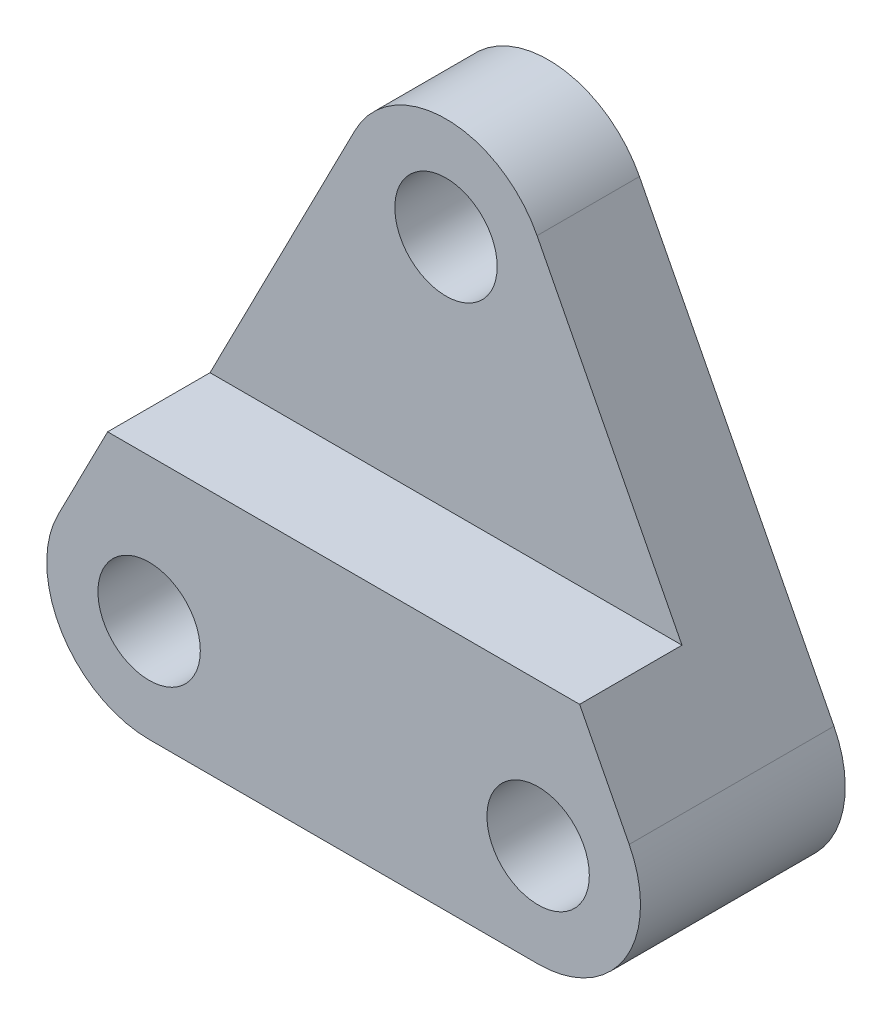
from build123d import *

# Parameters (mm, degrees)
SKETCH_1_R      = 5
EXTRUDE_1_DEPTH = 10
SKETCH_2_R      = 5
EXTRUDE_2_DEPTH = 10


with BuildPart() as part:
    # Sketch 1 → Extrude 1 (new body)
    with BuildSketch(Plane.XY):
        with BuildLine():
            Line((-8.895670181, 4.56804685), (-27.895670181, -32.43195315))
            ThreePointArc((-27.895670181, -32.43195315), (-27.534649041, -42.211503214), (-19, -47))
            Line((-19, -47), (19, -47))
            ThreePointArc((19, -47), (27.534649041, -42.211503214), (27.895670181, -32.43195315))
            Line((27.895670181, -32.43195315), (8.895670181, 4.56804685))
            ThreePointArc((8.895670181, 4.56804685), (0, 10), (-8.895670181, 4.56804685))
        make_face()
        Circle(SKETCH_1_R, mode=Mode.SUBTRACT)
        with Locations((-19, -37)):
            Circle(SKETCH_1_R, mode=Mode.SUBTRACT)
        with Locations((19, -37)):
            Circle(SKETCH_1_R, mode=Mode.SUBTRACT)
    extrude(amount=EXTRUDE_1_DEPTH)

    # Sketch 2 → Extrude 2 (add)
    with BuildSketch(Plane.XY.offset(10)):
        with BuildLine():
            Line((-23.05223478, -23), (23.05223478, -23))
            Line((23.05223478, -23), (27.895670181, -32.43195315))
            ThreePointArc((27.895670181, -32.43195315), (27.534649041, -42.211503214), (19, -47))
            Line((19, -47), (-19, -47))
            ThreePointArc((-19, -47), (-27.534649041, -42.211503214), (-27.895670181, -32.43195315))
            Line((-27.895670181, -32.43195315), (-23.05223478, -23))
        make_face()
        with Locations((19, -37)):
            Circle(SKETCH_2_R, mode=Mode.SUBTRACT)
        with Locations((-19, -37)):
            Circle(SKETCH_2_R, mode=Mode.SUBTRACT)
    extrude(amount=EXTRUDE_2_DEPTH)


solid = part.part
